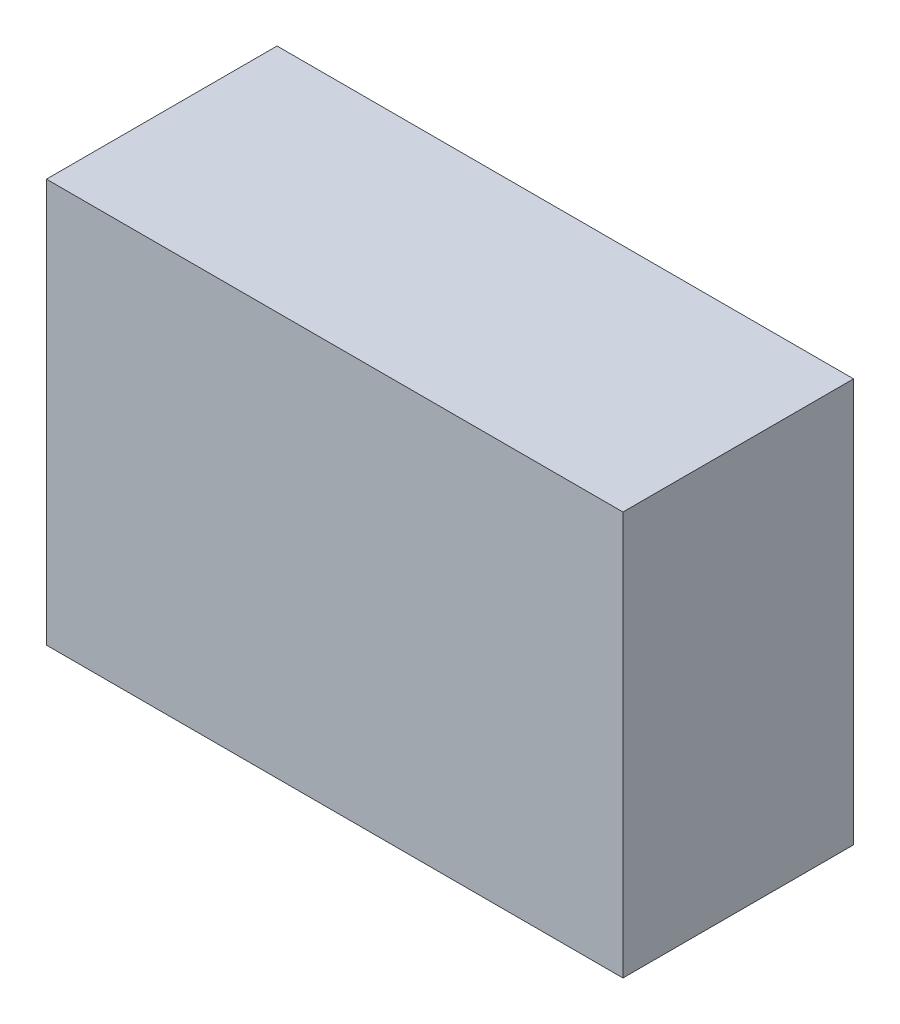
ISO-10303-21;
HEADER;
FILE_DESCRIPTION(('STEP AP214'),'2;1');
FILE_NAME('part.step','',(''),(''),'','','');
FILE_SCHEMA(('AUTOMOTIVE_DESIGN { 1 0 10303 214 1 1 1 1 }'));
ENDSEC;
DATA;
#1=APPLICATION_CONTEXT('core data for automotive mechanical design processes');
#2=APPLICATION_PROTOCOL_DEFINITION('international standard','automotive_design',2000,#1);
#3=PRODUCT_CONTEXT('',#1,'mechanical');
#4=PRODUCT('Part','Part','',(#3));
#5=PRODUCT_RELATED_PRODUCT_CATEGORY('part','',(#4));
#6=PRODUCT_DEFINITION_FORMATION('','',#4);
#7=PRODUCT_DEFINITION_CONTEXT('part definition',#1,'design');
#8=PRODUCT_DEFINITION('design','',#6,#7);
#9=PRODUCT_DEFINITION_SHAPE('','',#8);
#10=(LENGTH_UNIT() NAMED_UNIT(*) SI_UNIT(.MILLI.,.METRE.));
#11=(NAMED_UNIT(*) PLANE_ANGLE_UNIT() SI_UNIT($,.RADIAN.));
#12=(NAMED_UNIT(*) SI_UNIT($,.STERADIAN.) SOLID_ANGLE_UNIT());
#13=UNCERTAINTY_MEASURE_WITH_UNIT(LENGTH_MEASURE(1.E-05),#10,'distance_accuracy_value','');
#14=(GEOMETRIC_REPRESENTATION_CONTEXT(3) GLOBAL_UNCERTAINTY_ASSIGNED_CONTEXT((#13)) GLOBAL_UNIT_ASSIGNED_CONTEXT((#10,
#11,#12)) REPRESENTATION_CONTEXT('',''));
#15=CARTESIAN_POINT('',(0.,0.,0.));
#16=DIRECTION('',(0.,0.,1.));
#17=DIRECTION('',(1.,0.,0.));
#18=AXIS2_PLACEMENT_3D('',#15,#16,#17);
#19=CARTESIAN_POINT('',(-50.,-35.,40.));
#20=DIRECTION('',(1.,0.,0.));
#21=DIRECTION('',(0.,0.,-1.));
#22=AXIS2_PLACEMENT_3D('',#19,#20,#21);
#23=PLANE('',#22);
#24=DIRECTION('',(0.,-1.,0.));
#25=VECTOR('',#24,1.);
#26=CARTESIAN_POINT('',(-50.,-35.,0.));
#27=LINE('',#26,#25);
#28=CARTESIAN_POINT('',(-50.,35.,0.));
#29=VERTEX_POINT('',#28);
#30=CARTESIAN_POINT('',(-50.,-35.,0.));
#31=VERTEX_POINT('',#30);
#32=EDGE_CURVE('E95',#29,#31,#27,.T.);
#33=ORIENTED_EDGE('',*,*,#32,.T.);
#34=DIRECTION('',(0.,0.,-1.));
#35=VECTOR('',#34,1.);
#36=CARTESIAN_POINT('',(-50.,-35.,40.));
#37=LINE('',#36,#35);
#38=CARTESIAN_POINT('',(-50.,-35.,40.));
#39=VERTEX_POINT('',#38);
#40=EDGE_CURVE('E11',#39,#31,#37,.T.);
#41=ORIENTED_EDGE('',*,*,#40,.F.);
#42=DIRECTION('',(0.,-1.,0.));
#43=VECTOR('',#42,1.);
#44=CARTESIAN_POINT('',(-50.,-35.,40.));
#45=LINE('',#44,#43);
#46=CARTESIAN_POINT('',(-50.,35.,40.));
#47=VERTEX_POINT('',#46);
#48=EDGE_CURVE('E83',#47,#39,#45,.T.);
#49=ORIENTED_EDGE('',*,*,#48,.F.);
#50=DIRECTION('',(0.,0.,-1.));
#51=VECTOR('',#50,1.);
#52=CARTESIAN_POINT('',(-50.,35.,40.));
#53=LINE('',#52,#51);
#54=EDGE_CURVE('E91',#47,#29,#53,.T.);
#55=ORIENTED_EDGE('',*,*,#54,.T.);
#56=EDGE_LOOP('',(#33,#41,#49,#55));
#57=FACE_BOUND('',#56,.T.);
#58=ADVANCED_FACE('F32',(#57),#23,.F.);
#59=CARTESIAN_POINT('',(50.,-35.,40.));
#60=DIRECTION('',(0.,1.,0.));
#61=DIRECTION('',(-1.,0.,0.));
#62=AXIS2_PLACEMENT_3D('',#59,#60,#61);
#63=PLANE('',#62);
#64=CARTESIAN_POINT('',(-25.,-35.,20.));
#65=DIRECTION('',(0.,-1.,0.));
#66=DIRECTION('',(1.,0.,0.));
#67=AXIS2_PLACEMENT_3D('',#64,#65,#66);
#68=CIRCLE('',#67,9.);
#69=CARTESIAN_POINT('',(-16.,-35.,20.));
#70=VERTEX_POINT('',#69);
#71=EDGE_CURVE('E115',#70,#70,#68,.T.);
#72=ORIENTED_EDGE('',*,*,#71,.F.);
#73=EDGE_LOOP('',(#72));
#74=FACE_BOUND('',#73,.T.);
#75=CARTESIAN_POINT('',(25.,-35.,20.));
#76=DIRECTION('',(0.,-1.,0.));
#77=DIRECTION('',(1.,0.,0.));
#78=AXIS2_PLACEMENT_3D('',#75,#76,#77);
#79=CIRCLE('',#78,9.00000000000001);
#80=CARTESIAN_POINT('',(34.,-35.,20.));
#81=VERTEX_POINT('',#80);
#82=EDGE_CURVE('E109',#81,#81,#79,.T.);
#83=ORIENTED_EDGE('',*,*,#82,.F.);
#84=EDGE_LOOP('',(#83));
#85=FACE_BOUND('',#84,.T.);
#86=DIRECTION('',(1.,0.,0.));
#87=VECTOR('',#86,1.);
#88=CARTESIAN_POINT('',(50.,-35.,0.));
#89=LINE('',#88,#87);
#90=CARTESIAN_POINT('',(50.,-35.,0.));
#91=VERTEX_POINT('',#90);
#92=EDGE_CURVE('E87',#31,#91,#89,.T.);
#93=ORIENTED_EDGE('',*,*,#92,.T.);
#94=DIRECTION('',(0.,0.,-1.));
#95=VECTOR('',#94,1.);
#96=CARTESIAN_POINT('',(50.,-35.,40.));
#97=LINE('',#96,#95);
#98=CARTESIAN_POINT('',(50.,-35.,40.));
#99=VERTEX_POINT('',#98);
#100=EDGE_CURVE('E40',#99,#91,#97,.T.);
#101=ORIENTED_EDGE('',*,*,#100,.F.);
#102=DIRECTION('',(1.,0.,0.));
#103=VECTOR('',#102,1.);
#104=CARTESIAN_POINT('',(50.,-35.,40.));
#105=LINE('',#104,#103);
#106=EDGE_CURVE('E78',#39,#99,#105,.T.);
#107=ORIENTED_EDGE('',*,*,#106,.F.);
#108=ORIENTED_EDGE('',*,*,#40,.T.);
#109=EDGE_LOOP('',(#93,#101,#107,#108));
#110=FACE_BOUND('',#109,.T.);
#111=ADVANCED_FACE('F86',(#74,#85,#110),#63,.F.);
#112=CARTESIAN_POINT('',(50.,-35.,40.));
#113=DIRECTION('',(-1.,0.,0.));
#114=DIRECTION('',(0.,0.,1.));
#115=AXIS2_PLACEMENT_3D('',#112,#113,#114);
#116=PLANE('',#115);
#117=DIRECTION('',(0.,1.,0.));
#118=VECTOR('',#117,1.);
#119=CARTESIAN_POINT('',(50.,-35.,0.));
#120=LINE('',#119,#118);
#121=CARTESIAN_POINT('',(50.,35.,0.));
#122=VERTEX_POINT('',#121);
#123=EDGE_CURVE('E65',#91,#122,#120,.T.);
#124=ORIENTED_EDGE('',*,*,#123,.T.);
#125=DIRECTION('',(0.,0.,-1.));
#126=VECTOR('',#125,1.);
#127=CARTESIAN_POINT('',(50.,35.,40.));
#128=LINE('',#127,#126);
#129=CARTESIAN_POINT('',(50.,35.,40.));
#130=VERTEX_POINT('',#129);
#131=EDGE_CURVE('E88',#130,#122,#128,.T.);
#132=ORIENTED_EDGE('',*,*,#131,.F.);
#133=DIRECTION('',(0.,1.,0.));
#134=VECTOR('',#133,1.);
#135=CARTESIAN_POINT('',(50.,-35.,40.));
#136=LINE('',#135,#134);
#137=EDGE_CURVE('E81',#99,#130,#136,.T.);
#138=ORIENTED_EDGE('',*,*,#137,.F.);
#139=ORIENTED_EDGE('',*,*,#100,.T.);
#140=EDGE_LOOP('',(#124,#132,#138,#139));
#141=FACE_BOUND('',#140,.T.);
#142=ADVANCED_FACE('F89',(#141),#116,.F.);
#143=CARTESIAN_POINT('',(50.,35.,40.));
#144=DIRECTION('',(0.,-1.,0.));
#145=DIRECTION('',(1.,0.,0.));
#146=AXIS2_PLACEMENT_3D('',#143,#144,#145);
#147=PLANE('',#146);
#148=DIRECTION('',(-1.,0.,0.));
#149=VECTOR('',#148,1.);
#150=CARTESIAN_POINT('',(50.,35.,0.));
#151=LINE('',#150,#149);
#152=EDGE_CURVE('E71',#122,#29,#151,.T.);
#153=ORIENTED_EDGE('',*,*,#152,.T.);
#154=ORIENTED_EDGE('',*,*,#54,.F.);
#155=DIRECTION('',(-1.,0.,0.));
#156=VECTOR('',#155,1.);
#157=CARTESIAN_POINT('',(50.,35.,40.));
#158=LINE('',#157,#156);
#159=EDGE_CURVE('E48',#130,#47,#158,.T.);
#160=ORIENTED_EDGE('',*,*,#159,.F.);
#161=ORIENTED_EDGE('',*,*,#131,.T.);
#162=EDGE_LOOP('',(#153,#154,#160,#161));
#163=FACE_BOUND('',#162,.T.);
#164=ADVANCED_FACE('F103',(#163),#147,.F.);
#165=CARTESIAN_POINT('',(0.,0.,40.));
#166=DIRECTION('',(0.,0.,1.));
#167=DIRECTION('',(1.,0.,0.));
#168=AXIS2_PLACEMENT_3D('',#165,#166,#167);
#169=PLANE('',#168);
#170=ORIENTED_EDGE('',*,*,#48,.T.);
#171=ORIENTED_EDGE('',*,*,#106,.T.);
#172=ORIENTED_EDGE('',*,*,#137,.T.);
#173=ORIENTED_EDGE('',*,*,#159,.T.);
#174=EDGE_LOOP('',(#170,#171,#172,#173));
#175=FACE_BOUND('',#174,.T.);
#176=ADVANCED_FACE('F79',(#175),#169,.T.);
#177=CARTESIAN_POINT('',(0.,0.,0.));
#178=DIRECTION('',(0.,0.,1.));
#179=DIRECTION('',(1.,0.,0.));
#180=AXIS2_PLACEMENT_3D('',#177,#178,#179);
#181=PLANE('',#180);
#182=ORIENTED_EDGE('',*,*,#32,.F.);
#183=ORIENTED_EDGE('',*,*,#152,.F.);
#184=ORIENTED_EDGE('',*,*,#123,.F.);
#185=ORIENTED_EDGE('',*,*,#92,.F.);
#186=EDGE_LOOP('',(#182,#183,#184,#185));
#187=FACE_BOUND('',#186,.T.);
#188=ADVANCED_FACE('F106',(#187),#181,.F.);
#189=CARTESIAN_POINT('',(25.,0.,20.));
#190=DIRECTION('',(0.,-1.,0.));
#191=DIRECTION('',(1.,0.,0.));
#192=AXIS2_PLACEMENT_3D('',#189,#190,#191);
#193=CYLINDRICAL_SURFACE('',#192,9.00000000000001);
#194=CARTESIAN_POINT('',(25.,0.,20.));
#195=DIRECTION('',(0.,-1.,0.));
#196=DIRECTION('',(1.,0.,0.));
#197=AXIS2_PLACEMENT_3D('',#194,#195,#196);
#198=CIRCLE('',#197,9.00000000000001);
#199=CARTESIAN_POINT('',(34.,0.,20.));
#200=VERTEX_POINT('',#199);
#201=EDGE_CURVE('E112',#200,#200,#198,.T.);
#202=ORIENTED_EDGE('',*,*,#201,.F.);
#203=EDGE_LOOP('',(#202));
#204=FACE_BOUND('',#203,.T.);
#205=ORIENTED_EDGE('',*,*,#82,.T.);
#206=EDGE_LOOP('',(#205));
#207=FACE_BOUND('',#206,.T.);
#208=ADVANCED_FACE('F134',(#204,#207),#193,.F.);
#209=CARTESIAN_POINT('',(25.,0.,20.));
#210=DIRECTION('',(0.,-1.,0.));
#211=DIRECTION('',(1.,0.,0.));
#212=AXIS2_PLACEMENT_3D('',#209,#210,#211);
#213=PLANE('',#212);
#214=ORIENTED_EDGE('',*,*,#201,.T.);
#215=EDGE_LOOP('',(#214));
#216=FACE_BOUND('',#215,.T.);
#217=ADVANCED_FACE('F126',(#216),#213,.T.);
#218=CARTESIAN_POINT('',(-25.,0.,20.));
#219=DIRECTION('',(0.,-1.,0.));
#220=DIRECTION('',(1.,0.,0.));
#221=AXIS2_PLACEMENT_3D('',#218,#219,#220);
#222=CYLINDRICAL_SURFACE('',#221,9.);
#223=CARTESIAN_POINT('',(-25.,0.,20.));
#224=DIRECTION('',(0.,-1.,0.));
#225=DIRECTION('',(1.,0.,0.));
#226=AXIS2_PLACEMENT_3D('',#223,#224,#225);
#227=CIRCLE('',#226,9.);
#228=CARTESIAN_POINT('',(-16.,0.,20.));
#229=VERTEX_POINT('',#228);
#230=EDGE_CURVE('E98',#229,#229,#227,.T.);
#231=ORIENTED_EDGE('',*,*,#230,.F.);
#232=EDGE_LOOP('',(#231));
#233=FACE_BOUND('',#232,.T.);
#234=ORIENTED_EDGE('',*,*,#71,.T.);
#235=EDGE_LOOP('',(#234));
#236=FACE_BOUND('',#235,.T.);
#237=ADVANCED_FACE('F123',(#233,#236),#222,.F.);
#238=CARTESIAN_POINT('',(-25.,0.,20.));
#239=DIRECTION('',(0.,-1.,0.));
#240=DIRECTION('',(1.,0.,0.));
#241=AXIS2_PLACEMENT_3D('',#238,#239,#240);
#242=PLANE('',#241);
#243=ORIENTED_EDGE('',*,*,#230,.T.);
#244=EDGE_LOOP('',(#243));
#245=FACE_BOUND('',#244,.T.);
#246=ADVANCED_FACE('F121',(#245),#242,.T.);
#247=CLOSED_SHELL('',(#58,#111,#142,#164,#176,#188,#208,#217,#237,#246));
#248=MANIFOLD_SOLID_BREP('B2',#247);
#249=ADVANCED_BREP_SHAPE_REPRESENTATION('',(#18,#248),#14);
#250=SHAPE_DEFINITION_REPRESENTATION(#9,#249);
ENDSEC;
END-ISO-10303-21;
